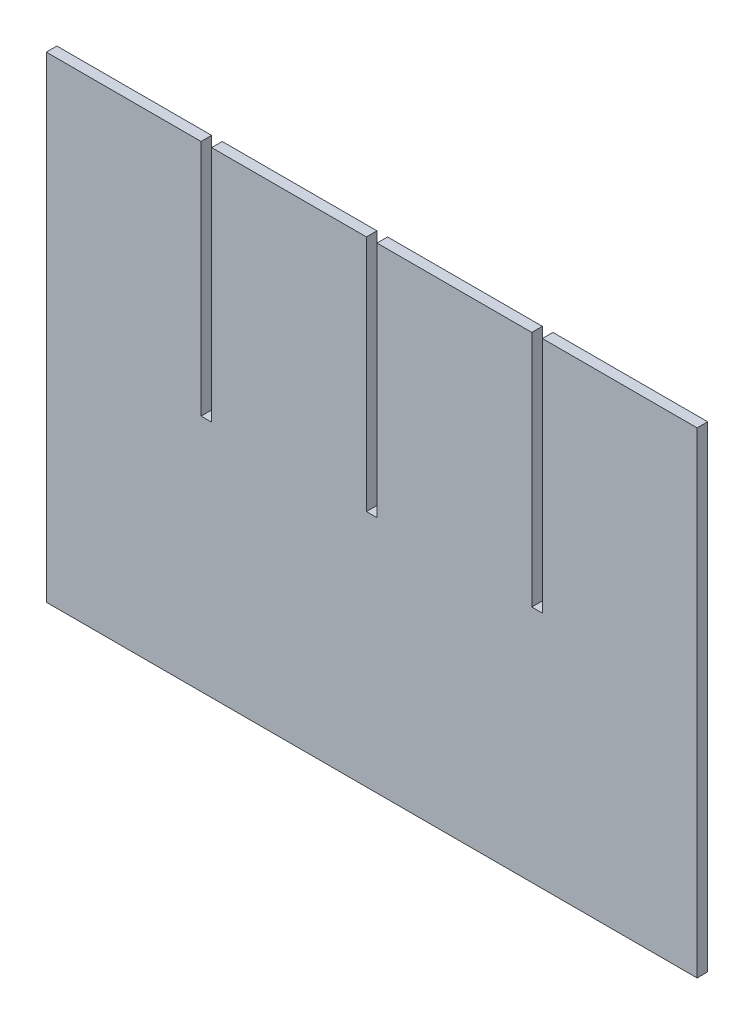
from build123d import *

# Parameters (mm, degrees)
BOSS_EXTRUDE1_DEPTH = 3.556


with BuildPart() as part:
    # Sketch1 → Boss-Extrude1 (new body)
    with BuildSketch(Plane.XY):
        Polygon((218.948, 160.274), (218.948, 0), (0, 0), (0, 160.274), (52.07, 160.274), (52.07, 80.264), (55.626, 80.264), (55.626, 160.274), (107.696, 160.274), (107.696, 80.264), (111.252, 80.264), (111.252, 160.274), (163.322, 160.274), (163.322, 80.264), (166.878, 80.264), (166.878, 160.274), align=None)
    extrude(amount=BOSS_EXTRUDE1_DEPTH)


solid = part.part
